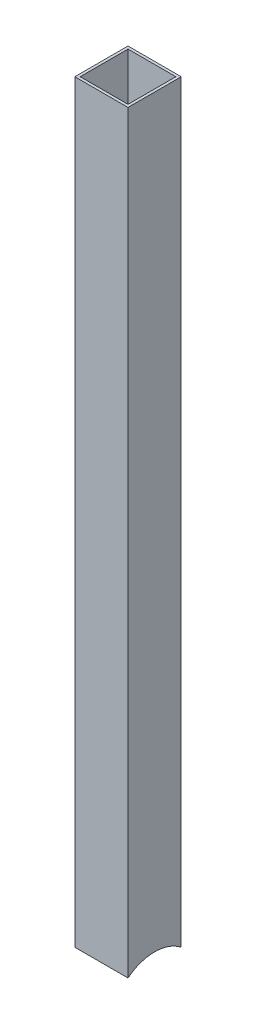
ISO-10303-21;
HEADER;
FILE_DESCRIPTION(('STEP AP214'),'2;1');
FILE_NAME('part.step','',(''),(''),'','','');
FILE_SCHEMA(('AUTOMOTIVE_DESIGN { 1 0 10303 214 1 1 1 1 }'));
ENDSEC;
DATA;
#1=APPLICATION_CONTEXT('core data for automotive mechanical design processes');
#2=APPLICATION_PROTOCOL_DEFINITION('international standard','automotive_design',2000,#1);
#3=PRODUCT_CONTEXT('',#1,'mechanical');
#4=PRODUCT('Part','Part','',(#3));
#5=PRODUCT_RELATED_PRODUCT_CATEGORY('part','',(#4));
#6=PRODUCT_DEFINITION_FORMATION('','',#4);
#7=PRODUCT_DEFINITION_CONTEXT('part definition',#1,'design');
#8=PRODUCT_DEFINITION('design','',#6,#7);
#9=PRODUCT_DEFINITION_SHAPE('','',#8);
#10=(LENGTH_UNIT() NAMED_UNIT(*) SI_UNIT(.MILLI.,.METRE.));
#11=(NAMED_UNIT(*) PLANE_ANGLE_UNIT() SI_UNIT($,.RADIAN.));
#12=(NAMED_UNIT(*) SI_UNIT($,.STERADIAN.) SOLID_ANGLE_UNIT());
#13=UNCERTAINTY_MEASURE_WITH_UNIT(LENGTH_MEASURE(1.E-05),#10,'distance_accuracy_value','');
#14=(GEOMETRIC_REPRESENTATION_CONTEXT(3) GLOBAL_UNCERTAINTY_ASSIGNED_CONTEXT((#13)) GLOBAL_UNIT_ASSIGNED_CONTEXT((#10,
#11,#12)) REPRESENTATION_CONTEXT('',''));
#15=CARTESIAN_POINT('',(0.,0.,0.));
#16=DIRECTION('',(0.,0.,1.));
#17=DIRECTION('',(1.,0.,0.));
#18=AXIS2_PLACEMENT_3D('',#15,#16,#17);
#19=CARTESIAN_POINT('',(25.,740.,-25.));
#20=DIRECTION('',(-1.,0.,0.));
#21=DIRECTION('',(0.,0.,1.));
#22=AXIS2_PLACEMENT_3D('',#19,#20,#21);
#23=PLANE('',#22);
#24=DIRECTION('',(0.,-1.,0.));
#25=VECTOR('',#24,1.);
#26=CARTESIAN_POINT('',(25.,740.,25.));
#27=LINE('',#26,#25);
#28=CARTESIAN_POINT('',(25.,740.,25.));
#29=VERTEX_POINT('',#28);
#30=CARTESIAN_POINT('',(25.,31.224989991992,25.));
#31=VERTEX_POINT('',#30);
#32=EDGE_CURVE('E115',#29,#31,#27,.T.);
#33=ORIENTED_EDGE('',*,*,#32,.T.);
#34=CARTESIAN_POINT('',(25.,0.,0.));
#35=DIRECTION('',(-1.,0.,0.));
#36=DIRECTION('',(0.,0.,1.));
#37=AXIS2_PLACEMENT_3D('',#34,#35,#36);
#38=CIRCLE('',#37,40.);
#39=CARTESIAN_POINT('',(25.,31.224989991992,-25.));
#40=VERTEX_POINT('',#39);
#41=EDGE_CURVE('E52',#31,#40,#38,.T.);
#42=ORIENTED_EDGE('',*,*,#41,.T.);
#43=DIRECTION('',(0.,-1.,0.));
#44=VECTOR('',#43,1.);
#45=CARTESIAN_POINT('',(25.,740.,-25.));
#46=LINE('',#45,#44);
#47=CARTESIAN_POINT('',(25.,740.,-25.));
#48=VERTEX_POINT('',#47);
#49=EDGE_CURVE('E45',#48,#40,#46,.T.);
#50=ORIENTED_EDGE('',*,*,#49,.F.);
#51=DIRECTION('',(0.,0.,-1.));
#52=VECTOR('',#51,1.);
#53=CARTESIAN_POINT('',(25.,740.,-25.));
#54=LINE('',#53,#52);
#55=EDGE_CURVE('E132',#29,#48,#54,.T.);
#56=ORIENTED_EDGE('',*,*,#55,.F.);
#57=EDGE_LOOP('',(#33,#42,#50,#56));
#58=FACE_BOUND('',#57,.T.);
#59=ADVANCED_FACE('F38',(#58),#23,.F.);
#60=CARTESIAN_POINT('',(-25.,740.,-25.));
#61=DIRECTION('',(0.,0.,1.));
#62=DIRECTION('',(1.,0.,0.));
#63=AXIS2_PLACEMENT_3D('',#60,#61,#62);
#64=PLANE('',#63);
#65=ORIENTED_EDGE('',*,*,#49,.T.);
#66=DIRECTION('',(-1.,0.,0.));
#67=VECTOR('',#66,1.);
#68=CARTESIAN_POINT('',(25.,31.224989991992,-25.));
#69=LINE('',#68,#67);
#70=CARTESIAN_POINT('',(-25.,31.224989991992,-25.));
#71=VERTEX_POINT('',#70);
#72=EDGE_CURVE('E99',#40,#71,#69,.T.);
#73=ORIENTED_EDGE('',*,*,#72,.T.);
#74=DIRECTION('',(0.,-1.,0.));
#75=VECTOR('',#74,1.);
#76=CARTESIAN_POINT('',(-25.,740.,-25.));
#77=LINE('',#76,#75);
#78=CARTESIAN_POINT('',(-25.,740.,-25.));
#79=VERTEX_POINT('',#78);
#80=EDGE_CURVE('E120',#79,#71,#77,.T.);
#81=ORIENTED_EDGE('',*,*,#80,.F.);
#82=DIRECTION('',(-1.,0.,0.));
#83=VECTOR('',#82,1.);
#84=CARTESIAN_POINT('',(-25.,740.,-25.));
#85=LINE('',#84,#83);
#86=EDGE_CURVE('E118',#48,#79,#85,.T.);
#87=ORIENTED_EDGE('',*,*,#86,.F.);
#88=EDGE_LOOP('',(#65,#73,#81,#87));
#89=FACE_BOUND('',#88,.T.);
#90=ADVANCED_FACE('F117',(#89),#64,.F.);
#91=CARTESIAN_POINT('',(-25.,740.,-25.));
#92=DIRECTION('',(1.,0.,0.));
#93=DIRECTION('',(0.,0.,-1.));
#94=AXIS2_PLACEMENT_3D('',#91,#92,#93);
#95=PLANE('',#94);
#96=ORIENTED_EDGE('',*,*,#80,.T.);
#97=CARTESIAN_POINT('',(-25.,0.,0.));
#98=DIRECTION('',(-1.,0.,0.));
#99=DIRECTION('',(0.,0.,1.));
#100=AXIS2_PLACEMENT_3D('',#97,#98,#99);
#101=CIRCLE('',#100,40.);
#102=CARTESIAN_POINT('',(-25.,31.224989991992,25.));
#103=VERTEX_POINT('',#102);
#104=EDGE_CURVE('E102',#103,#71,#101,.T.);
#105=ORIENTED_EDGE('',*,*,#104,.F.);
#106=DIRECTION('',(0.,-1.,0.));
#107=VECTOR('',#106,1.);
#108=CARTESIAN_POINT('',(-25.,740.,25.));
#109=LINE('',#108,#107);
#110=CARTESIAN_POINT('',(-25.,740.,25.));
#111=VERTEX_POINT('',#110);
#112=EDGE_CURVE('E121',#111,#103,#109,.T.);
#113=ORIENTED_EDGE('',*,*,#112,.F.);
#114=DIRECTION('',(0.,0.,1.));
#115=VECTOR('',#114,1.);
#116=CARTESIAN_POINT('',(-25.,740.,-25.));
#117=LINE('',#116,#115);
#118=EDGE_CURVE('E129',#79,#111,#117,.T.);
#119=ORIENTED_EDGE('',*,*,#118,.F.);
#120=EDGE_LOOP('',(#96,#105,#113,#119));
#121=FACE_BOUND('',#120,.T.);
#122=ADVANCED_FACE('F194',(#121),#95,.F.);
#123=CARTESIAN_POINT('',(-25.,740.,25.));
#124=DIRECTION('',(0.,0.,-1.));
#125=DIRECTION('',(-1.,0.,0.));
#126=AXIS2_PLACEMENT_3D('',#123,#124,#125);
#127=PLANE('',#126);
#128=ORIENTED_EDGE('',*,*,#112,.T.);
#129=DIRECTION('',(-1.,0.,0.));
#130=VECTOR('',#129,1.);
#131=CARTESIAN_POINT('',(25.,31.224989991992,25.));
#132=LINE('',#131,#130);
#133=EDGE_CURVE('E108',#103,#31,#132,.F.);
#134=ORIENTED_EDGE('',*,*,#133,.T.);
#135=ORIENTED_EDGE('',*,*,#32,.F.);
#136=DIRECTION('',(1.,0.,0.));
#137=VECTOR('',#136,1.);
#138=CARTESIAN_POINT('',(-25.,740.,25.));
#139=LINE('',#138,#137);
#140=EDGE_CURVE('E127',#111,#29,#139,.T.);
#141=ORIENTED_EDGE('',*,*,#140,.F.);
#142=EDGE_LOOP('',(#128,#134,#135,#141));
#143=FACE_BOUND('',#142,.T.);
#144=ADVANCED_FACE('F187',(#143),#127,.F.);
#145=CARTESIAN_POINT('',(0.,740.,0.));
#146=DIRECTION('',(0.,1.,0.));
#147=DIRECTION('',(0.,0.,1.));
#148=AXIS2_PLACEMENT_3D('',#145,#146,#147);
#149=PLANE('',#148);
#150=DIRECTION('',(0.,0.,-1.));
#151=VECTOR('',#150,1.);
#152=CARTESIAN_POINT('',(22.5,740.,-25.));
#153=LINE('',#152,#151);
#154=CARTESIAN_POINT('',(22.5,740.,22.5));
#155=VERTEX_POINT('',#154);
#156=CARTESIAN_POINT('',(22.5,740.,-22.5));
#157=VERTEX_POINT('',#156);
#158=EDGE_CURVE('E107',#155,#157,#153,.T.);
#159=ORIENTED_EDGE('',*,*,#158,.F.);
#160=DIRECTION('',(1.,0.,0.));
#161=VECTOR('',#160,1.);
#162=CARTESIAN_POINT('',(-25.,740.,22.5));
#163=LINE('',#162,#161);
#164=CARTESIAN_POINT('',(-22.5,740.,22.5));
#165=VERTEX_POINT('',#164);
#166=EDGE_CURVE('E135',#165,#155,#163,.T.);
#167=ORIENTED_EDGE('',*,*,#166,.F.);
#168=DIRECTION('',(0.,0.,1.));
#169=VECTOR('',#168,1.);
#170=CARTESIAN_POINT('',(-22.5,740.,-25.));
#171=LINE('',#170,#169);
#172=CARTESIAN_POINT('',(-22.5,740.,-22.5));
#173=VERTEX_POINT('',#172);
#174=EDGE_CURVE('E138',#173,#165,#171,.T.);
#175=ORIENTED_EDGE('',*,*,#174,.F.);
#176=DIRECTION('',(-1.,0.,0.));
#177=VECTOR('',#176,1.);
#178=CARTESIAN_POINT('',(-25.,740.,-22.5));
#179=LINE('',#178,#177);
#180=EDGE_CURVE('E141',#157,#173,#179,.T.);
#181=ORIENTED_EDGE('',*,*,#180,.F.);
#182=EDGE_LOOP('',(#159,#167,#175,#181));
#183=FACE_BOUND('',#182,.T.);
#184=ORIENTED_EDGE('',*,*,#55,.T.);
#185=ORIENTED_EDGE('',*,*,#86,.T.);
#186=ORIENTED_EDGE('',*,*,#118,.T.);
#187=ORIENTED_EDGE('',*,*,#140,.T.);
#188=EDGE_LOOP('',(#184,#185,#186,#187));
#189=FACE_BOUND('',#188,.T.);
#190=ADVANCED_FACE('F172',(#183,#189),#149,.T.);
#191=CARTESIAN_POINT('',(22.5,740.,-25.));
#192=DIRECTION('',(-1.,0.,0.));
#193=DIRECTION('',(0.,0.,1.));
#194=AXIS2_PLACEMENT_3D('',#191,#192,#193);
#195=PLANE('',#194);
#196=CARTESIAN_POINT('',(22.5,0.,0.));
#197=DIRECTION('',(-1.,0.,0.));
#198=DIRECTION('',(0.,0.,1.));
#199=AXIS2_PLACEMENT_3D('',#196,#197,#198);
#200=CIRCLE('',#199,40.);
#201=CARTESIAN_POINT('',(22.5,33.0718913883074,22.5));
#202=VERTEX_POINT('',#201);
#203=CARTESIAN_POINT('',(22.5,33.0718913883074,-22.5));
#204=VERTEX_POINT('',#203);
#205=EDGE_CURVE('E155',#202,#204,#200,.T.);
#206=ORIENTED_EDGE('',*,*,#205,.F.);
#207=DIRECTION('',(0.,-1.,0.));
#208=VECTOR('',#207,1.);
#209=CARTESIAN_POINT('',(22.5,740.,22.5));
#210=LINE('',#209,#208);
#211=EDGE_CURVE('E137',#155,#202,#210,.T.);
#212=ORIENTED_EDGE('',*,*,#211,.F.);
#213=ORIENTED_EDGE('',*,*,#158,.T.);
#214=DIRECTION('',(0.,-1.,0.));
#215=VECTOR('',#214,1.);
#216=CARTESIAN_POINT('',(22.5,740.,-22.5));
#217=LINE('',#216,#215);
#218=EDGE_CURVE('E134',#157,#204,#217,.T.);
#219=ORIENTED_EDGE('',*,*,#218,.T.);
#220=EDGE_LOOP('',(#206,#212,#213,#219));
#221=FACE_BOUND('',#220,.T.);
#222=ADVANCED_FACE('F179',(#221),#195,.T.);
#223=CARTESIAN_POINT('',(-25.,740.,-22.5));
#224=DIRECTION('',(0.,0.,1.));
#225=DIRECTION('',(1.,0.,0.));
#226=AXIS2_PLACEMENT_3D('',#223,#224,#225);
#227=PLANE('',#226);
#228=DIRECTION('',(-1.,0.,0.));
#229=VECTOR('',#228,1.);
#230=CARTESIAN_POINT('',(25.,33.0718913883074,-22.5));
#231=LINE('',#230,#229);
#232=CARTESIAN_POINT('',(-22.5,33.0718913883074,-22.5));
#233=VERTEX_POINT('',#232);
#234=EDGE_CURVE('E157',#204,#233,#231,.T.);
#235=ORIENTED_EDGE('',*,*,#234,.F.);
#236=ORIENTED_EDGE('',*,*,#218,.F.);
#237=ORIENTED_EDGE('',*,*,#180,.T.);
#238=DIRECTION('',(0.,-1.,0.));
#239=VECTOR('',#238,1.);
#240=CARTESIAN_POINT('',(-22.5,740.,-22.5));
#241=LINE('',#240,#239);
#242=EDGE_CURVE('E147',#173,#233,#241,.T.);
#243=ORIENTED_EDGE('',*,*,#242,.T.);
#244=EDGE_LOOP('',(#235,#236,#237,#243));
#245=FACE_BOUND('',#244,.T.);
#246=ADVANCED_FACE('F168',(#245),#227,.T.);
#247=CARTESIAN_POINT('',(-22.5,740.,-25.));
#248=DIRECTION('',(1.,0.,0.));
#249=DIRECTION('',(0.,0.,-1.));
#250=AXIS2_PLACEMENT_3D('',#247,#248,#249);
#251=PLANE('',#250);
#252=CARTESIAN_POINT('',(-22.5,0.,0.));
#253=DIRECTION('',(1.,0.,0.));
#254=DIRECTION('',(0.,0.,-1.));
#255=AXIS2_PLACEMENT_3D('',#252,#253,#254);
#256=CIRCLE('',#255,40.);
#257=CARTESIAN_POINT('',(-22.5,33.0718913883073,22.5));
#258=VERTEX_POINT('',#257);
#259=EDGE_CURVE('E59',#233,#258,#256,.T.);
#260=ORIENTED_EDGE('',*,*,#259,.F.);
#261=ORIENTED_EDGE('',*,*,#242,.F.);
#262=ORIENTED_EDGE('',*,*,#174,.T.);
#263=DIRECTION('',(0.,-1.,0.));
#264=VECTOR('',#263,1.);
#265=CARTESIAN_POINT('',(-22.5,740.,22.5));
#266=LINE('',#265,#264);
#267=EDGE_CURVE('E144',#165,#258,#266,.T.);
#268=ORIENTED_EDGE('',*,*,#267,.T.);
#269=EDGE_LOOP('',(#260,#261,#262,#268));
#270=FACE_BOUND('',#269,.T.);
#271=ADVANCED_FACE('F166',(#270),#251,.T.);
#272=CARTESIAN_POINT('',(-25.,740.,22.5));
#273=DIRECTION('',(0.,0.,-1.));
#274=DIRECTION('',(-1.,0.,0.));
#275=AXIS2_PLACEMENT_3D('',#272,#273,#274);
#276=PLANE('',#275);
#277=DIRECTION('',(-1.,0.,0.));
#278=VECTOR('',#277,1.);
#279=CARTESIAN_POINT('',(25.,33.0718913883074,22.5));
#280=LINE('',#279,#278);
#281=EDGE_CURVE('E11',#258,#202,#280,.F.);
#282=ORIENTED_EDGE('',*,*,#281,.F.);
#283=ORIENTED_EDGE('',*,*,#267,.F.);
#284=ORIENTED_EDGE('',*,*,#166,.T.);
#285=ORIENTED_EDGE('',*,*,#211,.T.);
#286=EDGE_LOOP('',(#282,#283,#284,#285));
#287=FACE_BOUND('',#286,.T.);
#288=ADVANCED_FACE('F177',(#287),#276,.T.);
#289=CARTESIAN_POINT('',(25.,0.,0.));
#290=DIRECTION('',(-1.,0.,0.));
#291=DIRECTION('',(0.,0.,1.));
#292=AXIS2_PLACEMENT_3D('',#289,#290,#291);
#293=CYLINDRICAL_SURFACE('',#292,40.);
#294=ORIENTED_EDGE('',*,*,#205,.T.);
#295=ORIENTED_EDGE('',*,*,#234,.T.);
#296=ORIENTED_EDGE('',*,*,#259,.T.);
#297=ORIENTED_EDGE('',*,*,#281,.T.);
#298=EDGE_LOOP('',(#294,#295,#296,#297));
#299=FACE_BOUND('',#298,.T.);
#300=ORIENTED_EDGE('',*,*,#41,.F.);
#301=ORIENTED_EDGE('',*,*,#133,.F.);
#302=ORIENTED_EDGE('',*,*,#104,.T.);
#303=ORIENTED_EDGE('',*,*,#72,.F.);
#304=EDGE_LOOP('',(#300,#301,#302,#303));
#305=FACE_BOUND('',#304,.T.);
#306=ADVANCED_FACE('F100',(#299,#305),#293,.F.);
#307=CLOSED_SHELL('',(#59,#90,#122,#144,#190,#222,#246,#271,#288,#306));
#308=MANIFOLD_SOLID_BREP('B2',#307);
#309=ADVANCED_BREP_SHAPE_REPRESENTATION('',(#18,#308),#14);
#310=SHAPE_DEFINITION_REPRESENTATION(#9,#309);
ENDSEC;
END-ISO-10303-21;
